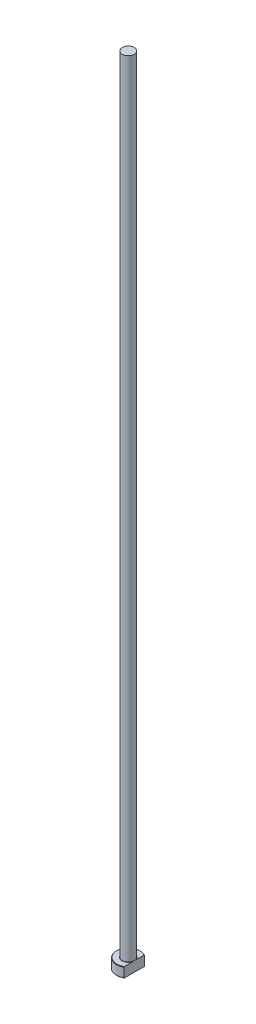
ISO-10303-21;
HEADER;
FILE_DESCRIPTION(('STEP AP214'),'2;1');
FILE_NAME('part.step','',(''),(''),'','','');
FILE_SCHEMA(('AUTOMOTIVE_DESIGN { 1 0 10303 214 1 1 1 1 }'));
ENDSEC;
DATA;
#1=APPLICATION_CONTEXT('core data for automotive mechanical design processes');
#2=APPLICATION_PROTOCOL_DEFINITION('international standard','automotive_design',2000,#1);
#3=PRODUCT_CONTEXT('',#1,'mechanical');
#4=PRODUCT('Part','Part','',(#3));
#5=PRODUCT_RELATED_PRODUCT_CATEGORY('part','',(#4));
#6=PRODUCT_DEFINITION_FORMATION('','',#4);
#7=PRODUCT_DEFINITION_CONTEXT('part definition',#1,'design');
#8=PRODUCT_DEFINITION('design','',#6,#7);
#9=PRODUCT_DEFINITION_SHAPE('','',#8);
#10=(LENGTH_UNIT() NAMED_UNIT(*) SI_UNIT(.MILLI.,.METRE.));
#11=(NAMED_UNIT(*) PLANE_ANGLE_UNIT() SI_UNIT($,.RADIAN.));
#12=(NAMED_UNIT(*) SI_UNIT($,.STERADIAN.) SOLID_ANGLE_UNIT());
#13=UNCERTAINTY_MEASURE_WITH_UNIT(LENGTH_MEASURE(1.E-05),#10,'distance_accuracy_value','');
#14=(GEOMETRIC_REPRESENTATION_CONTEXT(3) GLOBAL_UNCERTAINTY_ASSIGNED_CONTEXT((#13)) GLOBAL_UNIT_ASSIGNED_CONTEXT((#10,
#11,#12)) REPRESENTATION_CONTEXT('',''));
#15=CARTESIAN_POINT('',(0.,0.,0.));
#16=DIRECTION('',(0.,0.,1.));
#17=DIRECTION('',(1.,0.,0.));
#18=AXIS2_PLACEMENT_3D('',#15,#16,#17);
#19=CARTESIAN_POINT('',(0.,0.,0.));
#20=DIRECTION('',(0.,-1.,0.));
#21=DIRECTION('',(0.,0.,-1.));
#22=AXIS2_PLACEMENT_3D('',#19,#20,#21);
#23=PLANE('',#22);
#24=CARTESIAN_POINT('',(0.,0.,0.));
#25=DIRECTION('',(0.,-1.,0.));
#26=DIRECTION('',(0.,0.,-1.));
#27=AXIS2_PLACEMENT_3D('',#24,#25,#26);
#28=CIRCLE('',#27,5.79999999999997);
#29=CARTESIAN_POINT('',(2.99999999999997,0.,4.96386945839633));
#30=VERTEX_POINT('',#29);
#31=CARTESIAN_POINT('',(2.99999999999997,0.,-4.96386945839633));
#32=VERTEX_POINT('',#31);
#33=EDGE_CURVE('E98',#30,#32,#28,.T.);
#34=ORIENTED_EDGE('',*,*,#33,.T.);
#35=DIRECTION('',(0.,0.,1.));
#36=VECTOR('',#35,1.);
#37=CARTESIAN_POINT('',(2.99999999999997,0.,-5.19615242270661));
#38=LINE('',#37,#36);
#39=EDGE_CURVE('E83',#32,#30,#38,.T.);
#40=ORIENTED_EDGE('',*,*,#39,.T.);
#41=EDGE_LOOP('',(#34,#40));
#42=FACE_BOUND('',#41,.T.);
#43=ADVANCED_FACE('F32',(#42),#23,.T.);
#44=CARTESIAN_POINT('',(0.,259.958771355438,0.));
#45=DIRECTION('',(0.,1.,0.));
#46=DIRECTION('',(0.,0.,1.));
#47=AXIS2_PLACEMENT_3D('',#44,#45,#46);
#48=CYLINDRICAL_SURFACE('',#47,5.99999999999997);
#49=CARTESIAN_POINT('',(0.,4.80000000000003,0.));
#50=DIRECTION('',(0.,1.,0.));
#51=DIRECTION('',(0.,0.,1.));
#52=AXIS2_PLACEMENT_3D('',#49,#50,#51);
#53=CIRCLE('',#52,5.99999999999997);
#54=CARTESIAN_POINT('',(2.99999999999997,4.80000000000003,5.19615242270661));
#55=VERTEX_POINT('',#54);
#56=CARTESIAN_POINT('',(2.99999999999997,4.80000000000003,-5.19615242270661));
#57=VERTEX_POINT('',#56);
#58=EDGE_CURVE('E104',#55,#57,#53,.F.);
#59=ORIENTED_EDGE('',*,*,#58,.T.);
#60=DIRECTION('',(0.,-1.,0.));
#61=VECTOR('',#60,1.);
#62=CARTESIAN_POINT('',(2.99999999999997,400.,-5.19615242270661));
#63=LINE('',#62,#61);
#64=CARTESIAN_POINT('',(2.99999999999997,0.199999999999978,-5.19615242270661));
#65=VERTEX_POINT('',#64);
#66=EDGE_CURVE('E183',#57,#65,#63,.T.);
#67=ORIENTED_EDGE('',*,*,#66,.T.);
#68=CARTESIAN_POINT('',(0.,0.199999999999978,0.));
#69=DIRECTION('',(0.,-1.,0.));
#70=DIRECTION('',(0.,0.,-1.));
#71=AXIS2_PLACEMENT_3D('',#68,#69,#70);
#72=CIRCLE('',#71,5.99999999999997);
#73=CARTESIAN_POINT('',(2.99999999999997,0.199999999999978,5.19615242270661));
#74=VERTEX_POINT('',#73);
#75=EDGE_CURVE('E100',#65,#74,#72,.F.);
#76=ORIENTED_EDGE('',*,*,#75,.T.);
#77=DIRECTION('',(0.,-1.,0.));
#78=VECTOR('',#77,1.);
#79=CARTESIAN_POINT('',(2.99999999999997,400.,5.19615242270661));
#80=LINE('',#79,#78);
#81=EDGE_CURVE('E93',#55,#74,#80,.T.);
#82=ORIENTED_EDGE('',*,*,#81,.F.);
#83=EDGE_LOOP('',(#59,#67,#76,#82));
#84=FACE_BOUND('',#83,.T.);
#85=ADVANCED_FACE('F158',(#84),#48,.T.);
#86=CARTESIAN_POINT('',(-5.99999999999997,5.,0.));
#87=DIRECTION('',(0.,1.,0.));
#88=DIRECTION('',(0.,0.,1.));
#89=AXIS2_PLACEMENT_3D('',#86,#87,#88);
#90=PLANE('',#89);
#91=CARTESIAN_POINT('',(0.,5.,0.));
#92=DIRECTION('',(0.,1.,0.));
#93=DIRECTION('',(0.,0.,1.));
#94=AXIS2_PLACEMENT_3D('',#91,#92,#93);
#95=CIRCLE('',#94,5.79999999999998);
#96=CARTESIAN_POINT('',(2.99999999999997,5.,-4.96386945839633));
#97=VERTEX_POINT('',#96);
#98=CARTESIAN_POINT('',(2.99999999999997,5.,4.96386945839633));
#99=VERTEX_POINT('',#98);
#100=EDGE_CURVE('E178',#97,#99,#95,.T.);
#101=ORIENTED_EDGE('',*,*,#100,.T.);
#102=DIRECTION('',(0.,0.,-1.));
#103=VECTOR('',#102,1.);
#104=CARTESIAN_POINT('',(2.99999999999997,5.,0.));
#105=LINE('',#104,#103);
#106=CARTESIAN_POINT('',(2.99999999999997,4.99999999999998,1.11355287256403));
#107=VERTEX_POINT('',#106);
#108=EDGE_CURVE('E57',#99,#107,#105,.T.);
#109=ORIENTED_EDGE('',*,*,#108,.T.);
#110=CARTESIAN_POINT('',(0.,5.,0.));
#111=DIRECTION('',(0.,1.,0.));
#112=DIRECTION('',(0.,0.,1.));
#113=AXIS2_PLACEMENT_3D('',#110,#111,#112);
#114=CIRCLE('',#113,3.19999999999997);
#115=CARTESIAN_POINT('',(2.99999999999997,4.99999999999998,-1.113552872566));
#116=VERTEX_POINT('',#115);
#117=EDGE_CURVE('E107',#107,#116,#114,.F.);
#118=ORIENTED_EDGE('',*,*,#117,.T.);
#119=EDGE_CURVE('E136',#116,#97,#105,.T.);
#120=ORIENTED_EDGE('',*,*,#119,.T.);
#121=EDGE_LOOP('',(#101,#109,#118,#120));
#122=FACE_BOUND('',#121,.T.);
#123=ADVANCED_FACE('F147',(#122),#90,.T.);
#124=CARTESIAN_POINT('',(0.,5.,0.));
#125=DIRECTION('',(0.,-1.,0.));
#126=DIRECTION('',(0.,0.,-1.));
#127=AXIS2_PLACEMENT_3D('',#124,#125,#126);
#128=CONICAL_SURFACE('',#127,5.79999999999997,0.785398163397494);
#129=ORIENTED_EDGE('',*,*,#58,.F.);
#130=CARTESIAN_POINT('',(2.99999999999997,-1.01993959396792,11.432889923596));
#131=CARTESIAN_POINT('',(2.99999999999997,-0.769424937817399,11.1738796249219));
#132=CARTESIAN_POINT('',(2.99999999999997,-0.519179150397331,10.9146084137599));
#133=CARTESIAN_POINT('',(2.99999999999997,-0.0193842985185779,10.395389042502));
#134=CARTESIAN_POINT('',(2.99999999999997,0.230164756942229,10.1354408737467));
#135=CARTESIAN_POINT('',(2.99999999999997,0.728528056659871,9.61458602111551));
#136=CARTESIAN_POINT('',(2.99999999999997,0.977341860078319,9.35367891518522));
#137=CARTESIAN_POINT('',(2.99999999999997,1.47386965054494,8.83082274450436));
#138=CARTESIAN_POINT('',(2.99999999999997,1.72158364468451,8.56887368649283));
#139=CARTESIAN_POINT('',(2.99999999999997,2.21069282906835,8.04884148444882));
#140=CARTESIAN_POINT('',(2.99999999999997,2.4521159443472,7.79078462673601));
#141=CARTESIAN_POINT('',(2.99999999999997,2.93315589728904,7.27299342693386));
#142=CARTESIAN_POINT('',(2.99999999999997,3.17277274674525,7.01325909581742));
#143=CARTESIAN_POINT('',(2.99999999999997,3.64950020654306,6.49159990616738));
#144=CARTESIAN_POINT('',(2.99999999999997,3.88661134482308,6.22967553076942));
#145=CARTESIAN_POINT('',(2.99999999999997,4.35738571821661,5.70275148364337));
#146=CARTESIAN_POINT('',(2.99999999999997,4.59104909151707,5.43775193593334));
#147=CARTESIAN_POINT('',(2.99999999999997,4.96416348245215,5.00636825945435));
#148=CARTESIAN_POINT('',(2.99999999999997,5.1052013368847,4.8413584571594));
#149=CARTESIAN_POINT('',(2.99999999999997,5.38476673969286,4.50919282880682));
#150=CARTESIAN_POINT('',(2.99999999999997,5.52329404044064,4.34203679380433));
#151=CARTESIAN_POINT('',(2.99999999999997,5.79842961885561,4.0031993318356));
#152=CARTESIAN_POINT('',(2.99999999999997,5.93500216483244,3.83148875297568));
#153=CARTESIAN_POINT('',(2.99999999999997,6.20336281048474,3.4844211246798));
#154=CARTESIAN_POINT('',(2.99999999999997,6.33515205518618,3.30906496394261));
#155=CARTESIAN_POINT('',(2.99999999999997,6.5939338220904,2.9507080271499));
#156=CARTESIAN_POINT('',(2.99999999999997,6.72082315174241,2.76763161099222));
#157=CARTESIAN_POINT('',(2.99999999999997,6.90336321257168,2.48771743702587));
#158=CARTESIAN_POINT('',(2.99999999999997,6.96295431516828,2.39345390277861));
#159=CARTESIAN_POINT('',(2.99999999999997,7.07882720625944,2.20292146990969));
#160=CARTESIAN_POINT('',(2.99999999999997,7.13510937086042,2.10665280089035));
#161=CARTESIAN_POINT('',(2.99999999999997,7.24288059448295,1.91297779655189));
#162=CARTESIAN_POINT('',(2.99999999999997,7.29441986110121,1.81559978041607));
#163=CARTESIAN_POINT('',(2.99999999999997,7.39241237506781,1.61833215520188));
#164=CARTESIAN_POINT('',(2.99999999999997,7.43886469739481,1.51844209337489));
#165=CARTESIAN_POINT('',(2.99999999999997,7.56840030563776,1.21511948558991));
#166=CARTESIAN_POINT('',(2.99999999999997,7.64209011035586,1.00730397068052));
#167=CARTESIAN_POINT('',(2.99999999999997,7.72186700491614,0.695731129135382));
#168=CARTESIAN_POINT('',(2.99999999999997,7.74302901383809,0.595791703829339));
#169=CARTESIAN_POINT('',(2.99999999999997,7.77582528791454,0.394325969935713));
#170=CARTESIAN_POINT('',(2.99999999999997,7.78746040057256,0.292799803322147));
#171=CARTESIAN_POINT('',(2.99999999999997,7.80037895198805,0.0893987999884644));
#172=CARTESIAN_POINT('',(2.99999999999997,7.80169449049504,-0.0124739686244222));
#173=CARTESIAN_POINT('',(2.99999999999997,7.79396363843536,-0.215826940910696));
#174=CARTESIAN_POINT('',(2.99999999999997,7.78491639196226,-0.317307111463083));
#175=CARTESIAN_POINT('',(2.99999999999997,7.75721241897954,-0.518039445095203));
#176=CARTESIAN_POINT('',(2.99999999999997,7.73863812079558,-0.61730321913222));
#177=CARTESIAN_POINT('',(2.99999999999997,7.6930395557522,-0.813850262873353));
#178=CARTESIAN_POINT('',(2.99999999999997,7.66601427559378,-0.911133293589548));
#179=CARTESIAN_POINT('',(2.99999999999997,7.60464499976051,-1.10394843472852));
#180=CARTESIAN_POINT('',(2.99999999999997,7.57025976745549,-1.19946724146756));
#181=CARTESIAN_POINT('',(2.99999999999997,7.4955576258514,-1.38810736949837));
#182=CARTESIAN_POINT('',(2.99999999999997,7.45524192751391,-1.48122917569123));
#183=CARTESIAN_POINT('',(2.99999999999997,7.36961028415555,-1.66561491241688));
#184=CARTESIAN_POINT('',(2.99999999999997,7.32427350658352,-1.75686908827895));
#185=CARTESIAN_POINT('',(2.99999999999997,7.22966073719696,-1.93732130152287));
#186=CARTESIAN_POINT('',(2.99999999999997,7.18038388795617,-2.02651888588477));
#187=CARTESIAN_POINT('',(2.99999999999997,7.02771106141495,-2.29153460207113));
#188=CARTESIAN_POINT('',(2.99999999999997,6.91955486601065,-2.46460625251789));
#189=CARTESIAN_POINT('',(2.99999999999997,6.69440299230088,-2.80577028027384));
#190=CARTESIAN_POINT('',(2.99999999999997,6.57737415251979,-2.97384034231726));
#191=CARTESIAN_POINT('',(2.99999999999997,6.33748949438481,-3.30561771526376));
#192=CARTESIAN_POINT('',(2.99999999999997,6.21463662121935,-3.46932716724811));
#193=CARTESIAN_POINT('',(2.99999999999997,5.96308085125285,-3.79561670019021));
#194=CARTESIAN_POINT('',(2.99999999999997,5.83432224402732,-3.95815356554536));
#195=CARTESIAN_POINT('',(2.99999999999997,5.57361365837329,-4.28066737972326));
#196=CARTESIAN_POINT('',(2.99999999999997,5.44166333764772,-4.44064405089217));
#197=CARTESIAN_POINT('',(2.99999999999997,5.17568445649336,-4.75819552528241));
#198=CARTESIAN_POINT('',(2.99999999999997,5.04166171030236,-4.91577521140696));
#199=CARTESIAN_POINT('',(2.99999999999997,4.77176230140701,-5.22934053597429));
#200=CARTESIAN_POINT('',(2.99999999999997,4.63588560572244,-5.38532614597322));
#201=CARTESIAN_POINT('',(2.99999999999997,4.27256222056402,-5.79849838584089));
#202=CARTESIAN_POINT('',(2.99999999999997,4.04384014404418,-6.054562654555));
#203=CARTESIAN_POINT('',(2.99999999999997,3.58360020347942,-6.5641703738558));
#204=CARTESIAN_POINT('',(2.99999999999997,3.35208226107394,-6.81771375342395));
#205=CARTESIAN_POINT('',(2.99999999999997,2.88678846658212,-7.32315936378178));
#206=CARTESIAN_POINT('',(2.99999999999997,2.65301069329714,-7.57505982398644));
#207=CARTESIAN_POINT('',(2.99999999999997,2.18392232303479,-8.07742926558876));
#208=CARTESIAN_POINT('',(2.99999999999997,1.94861172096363,-8.32789824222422));
#209=CARTESIAN_POINT('',(2.99999999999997,1.4865158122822,-8.81743943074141));
#210=CARTESIAN_POINT('',(2.99999999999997,1.25977806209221,-9.05655656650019));
#211=CARTESIAN_POINT('',(2.99999999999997,0.805439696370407,-9.53397105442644));
#212=CARTESIAN_POINT('',(2.99999999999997,0.577839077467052,-9.77226840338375));
#213=CARTESIAN_POINT('',(2.99999999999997,0.122198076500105,-10.2479325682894));
#214=CARTESIAN_POINT('',(2.99999999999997,-0.105841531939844,-10.4853001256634));
#215=CARTESIAN_POINT('',(2.99999999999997,-0.562491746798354,-10.9594816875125));
#216=CARTESIAN_POINT('',(2.99999999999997,-0.791102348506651,-11.1962956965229));
#217=CARTESIAN_POINT('',(2.99999999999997,-1.01993959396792,-11.432889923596));
#218=B_SPLINE_CURVE_WITH_KNOTS('',3,(#130,#131,#132,#133,#134,#135,#136,#137,#138,#139,#140,
#141,#142,#143,#144,#145,#146,#147,#148,#149,#150,#151,#152,#153,#154,#155,#156,#157,#158,#159,
#160,#161,#162,#163,#164,#165,#166,#167,#168,#169,#170,#171,#172,#173,#174,#175,#176,#177,#178,
#179,#180,#181,#182,#183,#184,#185,#186,#187,#188,#189,#190,#191,#192,#193,#194,#195,#196,#197,
#198,#199,#200,#201,#202,#203,#204,#205,#206,#207,#208,#209,#210,#211,#212,#213,#214,#215,#216,
#217),.UNSPECIFIED.,.F.,.F.,(4,2,2,2,2,2,2,2,2,2,2,2,2,2,2,2,2,2,2,2,2,2,2,2,2,2,2,2,2,2,2,2,2,
2,2,2,2,2,2,2,2,2,2,4),(0.,1.08101662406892,2.16204714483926,3.24363027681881,4.32520642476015,
5.3853446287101,6.44547590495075,7.50537917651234,8.56523985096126,9.21643479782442,
9.86769362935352,10.5258323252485,11.1838124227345,11.851781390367,12.1862877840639,
12.5207560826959,12.8511332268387,13.1815703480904,13.8399161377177,14.1460077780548,
14.4520721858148,14.7571841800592,15.0623213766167,15.3648619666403,15.6674388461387,
15.9717575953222,16.2760142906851,16.5815843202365,16.8872210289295,17.4990577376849,
18.1133060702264,18.7272470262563,19.3492675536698,19.9713550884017,20.5919343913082,
21.2125247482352,22.2425132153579,23.2725306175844,24.3035181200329,25.3345090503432,
26.3230827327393,27.3116602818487,28.299135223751,29.286602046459),.UNSPECIFIED.);
#219=EDGE_CURVE('E135',#55,#99,#218,.T.);
#220=ORIENTED_EDGE('',*,*,#219,.T.);
#221=ORIENTED_EDGE('',*,*,#100,.F.);
#222=EDGE_CURVE('E127',#97,#57,#218,.T.);
#223=ORIENTED_EDGE('',*,*,#222,.T.);
#224=EDGE_LOOP('',(#129,#220,#221,#223));
#225=FACE_BOUND('',#224,.T.);
#226=ADVANCED_FACE('F143',(#225),#128,.T.);
#227=CARTESIAN_POINT('',(0.,0.199999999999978,0.));
#228=DIRECTION('',(0.,1.,0.));
#229=DIRECTION('',(0.,0.,1.));
#230=AXIS2_PLACEMENT_3D('',#227,#228,#229);
#231=CONICAL_SURFACE('',#230,5.99999999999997,0.785398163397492);
#232=ORIENTED_EDGE('',*,*,#75,.F.);
#233=CARTESIAN_POINT('',(2.99999999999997,6.01993959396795,-11.432889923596));
#234=CARTESIAN_POINT('',(2.99999999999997,5.76942493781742,-11.1738796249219));
#235=CARTESIAN_POINT('',(2.99999999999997,5.51917915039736,-10.9146084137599));
#236=CARTESIAN_POINT('',(2.99999999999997,5.0193842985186,-10.395389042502));
#237=CARTESIAN_POINT('',(2.99999999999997,4.76983524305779,-10.1354408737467));
#238=CARTESIAN_POINT('',(2.99999999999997,4.27147194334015,-9.6145860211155));
#239=CARTESIAN_POINT('',(2.99999999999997,4.0226581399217,-9.35367891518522));
#240=CARTESIAN_POINT('',(2.99999999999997,3.52613034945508,-8.83082274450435));
#241=CARTESIAN_POINT('',(2.99999999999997,3.27841635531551,-8.56887368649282));
#242=CARTESIAN_POINT('',(2.99999999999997,2.78930717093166,-8.04884148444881));
#243=CARTESIAN_POINT('',(2.99999999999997,2.54788405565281,-7.790784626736));
#244=CARTESIAN_POINT('',(2.99999999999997,2.06684410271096,-7.27299342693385));
#245=CARTESIAN_POINT('',(2.99999999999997,1.82722725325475,-7.01325909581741));
#246=CARTESIAN_POINT('',(2.99999999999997,1.35049979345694,-6.49159990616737));
#247=CARTESIAN_POINT('',(2.99999999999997,1.11338865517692,-6.22967553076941));
#248=CARTESIAN_POINT('',(2.99999999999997,0.642614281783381,-5.70275148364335));
#249=CARTESIAN_POINT('',(2.99999999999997,0.408950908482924,-5.43775193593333));
#250=CARTESIAN_POINT('',(2.99999999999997,0.0358365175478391,-5.00636825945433));
#251=CARTESIAN_POINT('',(2.99999999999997,-0.105201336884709,-4.84135845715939));
#252=CARTESIAN_POINT('',(2.99999999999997,-0.384766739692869,-4.50919282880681));
#253=CARTESIAN_POINT('',(2.99999999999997,-0.523294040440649,-4.34203679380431));
#254=CARTESIAN_POINT('',(2.99999999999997,-0.798429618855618,-4.00319933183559));
#255=CARTESIAN_POINT('',(2.99999999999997,-0.935002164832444,-3.83148875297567));
#256=CARTESIAN_POINT('',(2.99999999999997,-1.20336281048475,-3.48442112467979));
#257=CARTESIAN_POINT('',(2.99999999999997,-1.33515205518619,-3.3090649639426));
#258=CARTESIAN_POINT('',(2.99999999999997,-1.59393382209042,-2.95070802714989));
#259=CARTESIAN_POINT('',(2.99999999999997,-1.72082315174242,-2.76763161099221));
#260=CARTESIAN_POINT('',(2.99999999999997,-1.90336321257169,-2.48771743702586));
#261=CARTESIAN_POINT('',(2.99999999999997,-1.96295431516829,-2.3934539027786));
#262=CARTESIAN_POINT('',(2.99999999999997,-2.07882720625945,-2.20292146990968));
#263=CARTESIAN_POINT('',(2.99999999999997,-2.13510937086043,-2.10665280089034));
#264=CARTESIAN_POINT('',(2.99999999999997,-2.24288059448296,-1.91297779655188));
#265=CARTESIAN_POINT('',(2.99999999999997,-2.29441986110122,-1.81559978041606));
#266=CARTESIAN_POINT('',(2.99999999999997,-2.39241237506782,-1.61833215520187));
#267=CARTESIAN_POINT('',(2.99999999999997,-2.43886469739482,-1.51844209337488));
#268=CARTESIAN_POINT('',(2.99999999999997,-2.56840030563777,-1.2151194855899));
#269=CARTESIAN_POINT('',(2.99999999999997,-2.64209011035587,-1.00730397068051));
#270=CARTESIAN_POINT('',(2.99999999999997,-2.72186700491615,-0.695731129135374));
#271=CARTESIAN_POINT('',(2.99999999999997,-2.7430290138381,-0.59579170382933));
#272=CARTESIAN_POINT('',(2.99999999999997,-2.77582528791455,-0.394325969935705));
#273=CARTESIAN_POINT('',(2.99999999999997,-2.78746040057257,-0.29279980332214));
#274=CARTESIAN_POINT('',(2.99999999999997,-2.80037895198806,-0.0893987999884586));
#275=CARTESIAN_POINT('',(2.99999999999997,-2.80169449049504,0.0124739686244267));
#276=CARTESIAN_POINT('',(2.99999999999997,-2.79396363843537,0.215826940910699));
#277=CARTESIAN_POINT('',(2.99999999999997,-2.78491639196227,0.317307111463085));
#278=CARTESIAN_POINT('',(2.99999999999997,-2.75721241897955,0.518039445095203));
#279=CARTESIAN_POINT('',(2.99999999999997,-2.73863812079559,0.617303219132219));
#280=CARTESIAN_POINT('',(2.99999999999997,-2.6930395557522,0.813850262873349));
#281=CARTESIAN_POINT('',(2.99999999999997,-2.66601427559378,0.911133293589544));
#282=CARTESIAN_POINT('',(2.99999999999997,-2.60464499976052,1.10394843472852));
#283=CARTESIAN_POINT('',(2.99999999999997,-2.5702597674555,1.19946724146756));
#284=CARTESIAN_POINT('',(2.99999999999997,-2.49555762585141,1.38810736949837));
#285=CARTESIAN_POINT('',(2.99999999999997,-2.45524192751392,1.48122917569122));
#286=CARTESIAN_POINT('',(2.99999999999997,-2.36961028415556,1.66561491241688));
#287=CARTESIAN_POINT('',(2.99999999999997,-2.32427350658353,1.75686908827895));
#288=CARTESIAN_POINT('',(2.99999999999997,-2.22966073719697,1.93732130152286));
#289=CARTESIAN_POINT('',(2.99999999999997,-2.18038388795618,2.02651888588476));
#290=CARTESIAN_POINT('',(2.99999999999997,-2.02771106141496,2.29153460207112));
#291=CARTESIAN_POINT('',(2.99999999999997,-1.91955486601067,2.46460625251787));
#292=CARTESIAN_POINT('',(2.99999999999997,-1.6944029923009,2.80577028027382));
#293=CARTESIAN_POINT('',(2.99999999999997,-1.57737415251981,2.97384034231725));
#294=CARTESIAN_POINT('',(2.99999999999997,-1.33748949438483,3.30561771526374));
#295=CARTESIAN_POINT('',(2.99999999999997,-1.21463662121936,3.46932716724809));
#296=CARTESIAN_POINT('',(2.99999999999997,-0.963080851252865,3.79561670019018));
#297=CARTESIAN_POINT('',(2.99999999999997,-0.834322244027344,3.95815356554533));
#298=CARTESIAN_POINT('',(2.99999999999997,-0.573613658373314,4.28066737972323));
#299=CARTESIAN_POINT('',(2.99999999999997,-0.441663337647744,4.44064405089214));
#300=CARTESIAN_POINT('',(2.99999999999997,-0.175684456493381,4.75819552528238));
#301=CARTESIAN_POINT('',(2.99999999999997,-0.0416617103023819,4.91577521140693));
#302=CARTESIAN_POINT('',(2.99999999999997,0.228237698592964,5.22934053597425));
#303=CARTESIAN_POINT('',(2.99999999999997,0.364114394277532,5.38532614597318));
#304=CARTESIAN_POINT('',(2.99999999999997,0.727437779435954,5.79849838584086));
#305=CARTESIAN_POINT('',(2.99999999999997,0.956159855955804,6.05456265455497));
#306=CARTESIAN_POINT('',(2.99999999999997,1.41639979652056,6.56417037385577));
#307=CARTESIAN_POINT('',(2.99999999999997,1.64791773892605,6.81771375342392));
#308=CARTESIAN_POINT('',(2.99999999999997,2.11321153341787,7.32315936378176));
#309=CARTESIAN_POINT('',(2.99999999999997,2.34698930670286,7.57505982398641));
#310=CARTESIAN_POINT('',(2.99999999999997,2.8160776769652,8.07742926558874));
#311=CARTESIAN_POINT('',(2.99999999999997,3.05138827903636,8.3278982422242));
#312=CARTESIAN_POINT('',(2.99999999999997,3.5134841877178,8.81743943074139));
#313=CARTESIAN_POINT('',(2.99999999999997,3.7402219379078,9.05655656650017));
#314=CARTESIAN_POINT('',(2.99999999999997,4.1945603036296,9.53397105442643));
#315=CARTESIAN_POINT('',(2.99999999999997,4.42216092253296,9.77226840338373));
#316=CARTESIAN_POINT('',(2.99999999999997,4.87780192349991,10.2479325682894));
#317=CARTESIAN_POINT('',(2.99999999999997,5.10584153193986,10.4853001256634));
#318=CARTESIAN_POINT('',(2.99999999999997,5.56249174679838,10.9594816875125));
#319=CARTESIAN_POINT('',(2.99999999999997,5.79110234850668,11.1962956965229));
#320=CARTESIAN_POINT('',(2.99999999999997,6.01993959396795,11.432889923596));
#321=B_SPLINE_CURVE_WITH_KNOTS('',3,(#233,#234,#235,#236,#237,#238,#239,#240,#241,#242,#243,
#244,#245,#246,#247,#248,#249,#250,#251,#252,#253,#254,#255,#256,#257,#258,#259,#260,#261,#262,
#263,#264,#265,#266,#267,#268,#269,#270,#271,#272,#273,#274,#275,#276,#277,#278,#279,#280,#281,
#282,#283,#284,#285,#286,#287,#288,#289,#290,#291,#292,#293,#294,#295,#296,#297,#298,#299,#300,
#301,#302,#303,#304,#305,#306,#307,#308,#309,#310,#311,#312,#313,#314,#315,#316,#317,#318,#319,
#320),.UNSPECIFIED.,.F.,.F.,(4,2,2,2,2,2,2,2,2,2,2,2,2,2,2,2,2,2,2,2,2,2,2,2,2,2,2,2,2,2,2,2,2,
2,2,2,2,2,2,2,2,2,2,4),(0.,1.08101662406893,2.16204714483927,3.24363027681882,4.32520642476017,
5.38534462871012,6.44547590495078,7.50537917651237,8.5652398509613,9.21643479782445,
9.86769362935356,10.5258323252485,11.1838124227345,11.851781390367,12.186287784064,
12.5207560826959,12.8511332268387,13.1815703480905,13.8399161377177,14.1460077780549,
14.4520721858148,14.7571841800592,15.0623213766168,15.3648619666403,15.6674388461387,
15.9717575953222,16.2760142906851,16.5815843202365,16.8872210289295,17.4990577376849,
18.1133060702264,18.7272470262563,19.3492675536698,19.9713550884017,20.5919343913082,
21.2125247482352,22.2425132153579,23.2725306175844,24.3035181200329,25.3345090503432,
26.3230827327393,27.3116602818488,28.299135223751,29.286602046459),.UNSPECIFIED.);
#322=EDGE_CURVE('E86',#65,#32,#321,.T.);
#323=ORIENTED_EDGE('',*,*,#322,.T.);
#324=ORIENTED_EDGE('',*,*,#33,.F.);
#325=EDGE_CURVE('E89',#30,#74,#321,.T.);
#326=ORIENTED_EDGE('',*,*,#325,.T.);
#327=EDGE_LOOP('',(#232,#323,#324,#326));
#328=FACE_BOUND('',#327,.T.);
#329=ADVANCED_FACE('F97',(#328),#231,.T.);
#330=CARTESIAN_POINT('',(0.,5.19999999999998,0.));
#331=DIRECTION('',(0.,1.,0.));
#332=DIRECTION('',(0.,0.,1.));
#333=AXIS2_PLACEMENT_3D('',#330,#331,#332);
#334=TOROIDAL_SURFACE('',#333,3.19999999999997,0.2);
#335=CARTESIAN_POINT('',(2.99999999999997,5.19999999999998,0.));
#336=CARTESIAN_POINT('',(2.99999999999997,5.20000054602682,-8.25589702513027E-09));
#337=CARTESIAN_POINT('',(2.99999999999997,5.20000108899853,-2.22623702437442E-07));
#338=CARTESIAN_POINT('',(2.99999999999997,5.20000210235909,-8.13181300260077E-07));
#339=CARTESIAN_POINT('',(2.99999999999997,5.20000256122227,-1.20262206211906E-06));
#340=CARTESIAN_POINT('',(2.99999999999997,5.20000351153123,-2.13233189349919E-06));
#341=CARTESIAN_POINT('',(2.99999999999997,5.2000039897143,-2.68711073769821E-06));
#342=CARTESIAN_POINT('',(2.99999999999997,5.20000484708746,-3.83722986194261E-06));
#343=CARTESIAN_POINT('',(2.99999999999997,5.20000522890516,-4.43075968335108E-06));
#344=CARTESIAN_POINT('',(2.99999999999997,5.20000663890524,-6.71805399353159E-06));
#345=CARTESIAN_POINT('',(2.99999999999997,5.20000758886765,-8.46267320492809E-06));
#346=CARTESIAN_POINT('',(2.99999999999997,5.20000915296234,-1.19195937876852E-05));
#347=CARTESIAN_POINT('',(2.99999999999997,5.20000978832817,-1.36226966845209E-05));
#348=CARTESIAN_POINT('',(2.99999999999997,5.20001243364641,-2.07785327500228E-05));
#349=CARTESIAN_POINT('',(2.99999999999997,5.20001439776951,-2.62512686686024E-05));
#350=CARTESIAN_POINT('',(2.99999999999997,5.20001730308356,-3.65971251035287E-05));
#351=CARTESIAN_POINT('',(2.99999999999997,5.20001835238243,-4.14397201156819E-05));
#352=CARTESIAN_POINT('',(2.99999999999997,5.20002589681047,-7.68826107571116E-05));
#353=CARTESIAN_POINT('',(2.99999999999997,5.20003169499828,-0.000107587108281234));
#354=CARTESIAN_POINT('',(2.99999999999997,5.20005649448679,-0.000225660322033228));
#355=CARTESIAN_POINT('',(2.99999999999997,5.2000799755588,-0.000312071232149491));
#356=CARTESIAN_POINT('',(2.99999999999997,5.2001671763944,-0.000638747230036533));
#357=CARTESIAN_POINT('',(2.99999999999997,5.20022823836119,-0.000879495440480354));
#358=CARTESIAN_POINT('',(2.99999999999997,5.20046253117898,-0.00179757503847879));
#359=CARTESIAN_POINT('',(2.99999999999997,5.20063826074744,-0.00247448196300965));
#360=CARTESIAN_POINT('',(2.99999999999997,5.20145771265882,-0.00563611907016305));
#361=CARTESIAN_POINT('',(2.99999999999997,5.20209802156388,-0.00812138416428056));
#362=CARTESIAN_POINT('',(2.99999999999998,5.207470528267,-0.0289666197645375));
#363=CARTESIAN_POINT('',(2.99999999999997,5.2122144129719,-0.0473249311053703));
#364=CARTESIAN_POINT('',(2.99999999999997,5.2215041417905,-0.0833908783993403));
#365=CARTESIAN_POINT('',(2.99999999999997,5.22605099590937,-0.101098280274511));
#366=CARTESIAN_POINT('',(2.99999999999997,5.24071513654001,-0.158441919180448));
#367=CARTESIAN_POINT('',(2.99999999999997,5.25076238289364,-0.198096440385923));
#368=CARTESIAN_POINT('',(2.99999999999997,5.26735876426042,-0.264903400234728));
#369=CARTESIAN_POINT('',(2.99999999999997,5.27400650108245,-0.292031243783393));
#370=CARTESIAN_POINT('',(2.99999999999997,5.28691139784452,-0.345693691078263));
#371=CARTESIAN_POINT('',(2.99999999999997,5.29317409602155,-0.372226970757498));
#372=CARTESIAN_POINT('',(2.99999999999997,5.31359314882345,-0.460847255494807));
#373=CARTESIAN_POINT('',(2.99999999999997,5.3271194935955,-0.52308420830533));
#374=CARTESIAN_POINT('',(2.99999999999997,5.35185224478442,-0.648627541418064));
#375=CARTESIAN_POINT('',(2.99999999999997,5.36303576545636,-0.711938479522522));
#376=CARTESIAN_POINT('',(2.99999999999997,5.382697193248,-0.845442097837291));
#377=CARTESIAN_POINT('',(2.99999999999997,5.39079783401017,-0.915695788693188));
#378=CARTESIAN_POINT('',(2.99999999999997,5.39788104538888,-1.02128246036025));
#379=CARTESIAN_POINT('',(2.99999999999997,5.399399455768,-1.05644278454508));
#380=CARTESIAN_POINT('',(2.99999999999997,5.40031405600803,-1.12678521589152));
#381=CARTESIAN_POINT('',(2.99999999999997,5.39971158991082,-1.16196729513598));
#382=CARTESIAN_POINT('',(2.99999999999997,5.39660553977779,-1.21713951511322));
#383=CARTESIAN_POINT('',(2.99999999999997,5.39502683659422,-1.23718181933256));
#384=CARTESIAN_POINT('',(2.99999999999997,5.39080008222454,-1.27717351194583));
#385=CARTESIAN_POINT('',(2.99999999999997,5.38815120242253,-1.29712281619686));
#386=CARTESIAN_POINT('',(2.99999999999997,5.38160570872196,-1.33655702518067));
#387=CARTESIAN_POINT('',(2.99999999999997,5.37772556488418,-1.35604460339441));
#388=CARTESIAN_POINT('',(2.99999999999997,5.36841119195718,-1.39463554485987));
#389=CARTESIAN_POINT('',(2.99999999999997,5.36297874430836,-1.41373932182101));
#390=CARTESIAN_POINT('',(2.99999999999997,5.3500393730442,-1.45151809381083));
#391=CARTESIAN_POINT('',(2.99999999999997,5.34250654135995,-1.47018435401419));
#392=CARTESIAN_POINT('',(2.99999999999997,5.32469433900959,-1.50617232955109));
#393=CARTESIAN_POINT('',(2.99999999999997,5.31442814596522,-1.52349999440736));
#394=CARTESIAN_POINT('',(2.99999999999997,5.29768486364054,-1.5453003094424));
#395=CARTESIAN_POINT('',(2.99999999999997,5.29285641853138,-1.551032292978));
#396=CARTESIAN_POINT('',(2.99999999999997,5.28257691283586,-1.56192749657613));
#397=CARTESIAN_POINT('',(2.99999999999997,5.27712536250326,-1.56709026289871));
#398=CARTESIAN_POINT('',(2.99999999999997,5.26548354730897,-1.57666725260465));
#399=CARTESIAN_POINT('',(2.99999999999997,5.25928560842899,-1.58107232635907));
#400=CARTESIAN_POINT('',(2.99999999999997,5.24620912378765,-1.5887219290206));
#401=CARTESIAN_POINT('',(2.99999999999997,5.23933242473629,-1.59196950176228));
#402=CARTESIAN_POINT('',(2.99999999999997,5.22702406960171,-1.5962468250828));
#403=CARTESIAN_POINT('',(2.99999999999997,5.2217197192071,-1.59764171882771));
#404=CARTESIAN_POINT('',(2.99999999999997,5.2109516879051,-1.59951721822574));
#405=CARTESIAN_POINT('',(2.99999999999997,5.20548813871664,-1.59999855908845));
#406=CARTESIAN_POINT('',(2.99999999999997,5.19455397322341,-1.60000143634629));
#407=CARTESIAN_POINT('',(2.99999999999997,5.18908335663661,-1.59952177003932));
#408=CARTESIAN_POINT('',(2.99999999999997,5.17830149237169,-1.59764696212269));
#409=CARTESIAN_POINT('',(2.99999999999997,5.17299036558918,-1.59625114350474));
#410=CARTESIAN_POINT('',(2.99999999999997,5.16137413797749,-1.5922159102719));
#411=CARTESIAN_POINT('',(2.99999999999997,5.15514663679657,-1.58935479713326));
#412=CARTESIAN_POINT('',(2.99999999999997,5.14323789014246,-1.58266473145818));
#413=CARTESIAN_POINT('',(2.99999999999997,5.13755768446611,-1.57883398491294));
#414=CARTESIAN_POINT('',(2.99999999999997,5.12388989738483,-1.5682309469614));
#415=CARTESIAN_POINT('',(2.99999999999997,5.11627920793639,-1.56097697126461));
#416=CARTESIAN_POINT('',(2.99999999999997,5.10222993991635,-1.54541986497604));
#417=CARTESIAN_POINT('',(2.99999999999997,5.09579438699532,-1.53711411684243));
#418=CARTESIAN_POINT('',(2.99999999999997,5.07874447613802,-1.51234359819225));
#419=CARTESIAN_POINT('',(2.99999999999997,5.06934681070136,-1.49505024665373));
#420=CARTESIAN_POINT('',(2.99999999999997,5.05300413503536,-1.45936637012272));
#421=CARTESIAN_POINT('',(2.99999999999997,5.04606563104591,-1.440973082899));
#422=CARTESIAN_POINT('',(2.99999999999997,5.03343712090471,-1.40170303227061));
#423=CARTESIAN_POINT('',(2.99999999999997,5.02794514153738,-1.38076360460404));
#424=CARTESIAN_POINT('',(2.99999999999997,5.01869119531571,-1.33849708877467));
#425=CARTESIAN_POINT('',(2.99999999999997,5.01493126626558,-1.31716957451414));
#426=CARTESIAN_POINT('',(2.99999999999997,5.00879575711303,-1.27427301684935));
#427=CARTESIAN_POINT('',(2.99999999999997,5.00642327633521,-1.25270354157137));
#428=CARTESIAN_POINT('',(2.99999999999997,5.00283272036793,-1.20948719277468));
#429=CARTESIAN_POINT('',(2.99999999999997,5.00161392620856,-1.18784037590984));
#430=CARTESIAN_POINT('',(2.99999999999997,4.99921193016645,-1.11739576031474));
#431=CARTESIAN_POINT('',(2.99999999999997,4.99998309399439,-1.06853061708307));
#432=CARTESIAN_POINT('',(2.99999999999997,5.00498456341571,-0.970964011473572));
#433=CARTESIAN_POINT('',(2.99999999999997,5.00921876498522,-0.922262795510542));
#434=CARTESIAN_POINT('',(2.99999999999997,5.02027934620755,-0.825023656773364));
#435=CARTESIAN_POINT('',(2.99999999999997,5.02711306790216,-0.776486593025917));
#436=CARTESIAN_POINT('',(2.99999999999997,5.04272509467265,-0.679720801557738));
#437=CARTESIAN_POINT('',(2.99999999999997,5.05150395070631,-0.631492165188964));
#438=CARTESIAN_POINT('',(2.99999999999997,5.07999589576,-0.487173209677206));
#439=CARTESIAN_POINT('',(2.99999999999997,5.10185558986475,-0.391514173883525));
#440=CARTESIAN_POINT('',(2.99999999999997,5.14819769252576,-0.200831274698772));
#441=CARTESIAN_POINT('',(2.99999999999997,5.17268119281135,-0.105807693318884));
#442=CARTESIAN_POINT('',(2.99999999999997,5.19722910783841,-0.0107318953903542));
#443=CARTESIAN_POINT('',(2.99999999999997,5.19724528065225,-0.0106692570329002));
#444=CARTESIAN_POINT('',(2.99999999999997,5.19781243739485,-0.00847232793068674));
#445=CARTESIAN_POINT('',(2.99999999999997,5.19836102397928,-0.00633759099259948));
#446=CARTESIAN_POINT('',(2.99999999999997,5.1991597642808,-0.00325873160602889));
#447=CARTESIAN_POINT('',(2.99999999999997,5.19940591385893,-0.00231386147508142));
#448=CARTESIAN_POINT('',(2.99999999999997,5.19972567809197,-0.00105818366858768));
#449=CARTESIAN_POINT('',(2.99999999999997,5.19980400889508,-0.000748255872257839));
#450=CARTESIAN_POINT('',(2.99999999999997,5.1999122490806,-0.000340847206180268));
#451=CARTESIAN_POINT('',(2.99999999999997,5.19993871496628,-0.000242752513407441));
#452=CARTESIAN_POINT('',(2.99999999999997,5.19996623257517,-0.000111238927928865));
#453=CARTESIAN_POINT('',(2.99999999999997,5.19997237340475,-7.89037769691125E-05));
#454=CARTESIAN_POINT('',(2.99999999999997,5.19998062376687,-4.17973012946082E-05));
#455=CARTESIAN_POINT('',(2.99999999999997,5.19998174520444,-3.68646325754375E-05));
#456=CARTESIAN_POINT('',(2.99999999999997,5.19998486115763,-2.6333709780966E-05));
#457=CARTESIAN_POINT('',(2.99999999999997,5.19998697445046,-2.0770778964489E-05));
#458=CARTESIAN_POINT('',(2.99999999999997,5.19998981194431,-1.35213137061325E-05));
#459=CARTESIAN_POINT('',(2.99999999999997,5.19999048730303,-1.18115060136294E-05));
#460=CARTESIAN_POINT('',(2.99999999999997,5.19999214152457,-8.34771962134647E-06));
#461=CARTESIAN_POINT('',(2.99999999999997,5.19999314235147,-6.60378870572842E-06));
#462=CARTESIAN_POINT('',(2.99999999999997,5.1999946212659,-4.32501646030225E-06));
#463=CARTESIAN_POINT('',(2.99999999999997,5.1999950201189,-3.73587510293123E-06));
#464=CARTESIAN_POINT('',(2.99999999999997,5.19999591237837,-2.59760768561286E-06));
#465=CARTESIAN_POINT('',(2.99999999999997,5.19999640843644,-2.05040430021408E-06));
#466=CARTESIAN_POINT('',(2.99999999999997,5.19999738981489,-1.1384674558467E-06));
#467=CARTESIAN_POINT('',(2.99999999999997,5.19999786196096,-7.58552551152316E-07));
#468=CARTESIAN_POINT('',(2.99999999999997,5.19999889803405,-1.92079005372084E-07));
#469=CARTESIAN_POINT('',(2.99999999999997,5.19999945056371,8.30744745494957E-09));
#470=CARTESIAN_POINT('',(2.99999999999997,5.19999999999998,0.));
#471=B_SPLINE_CURVE_WITH_KNOTS('',3,(#335,#336,#337,#338,#339,#340,#341,#342,#343,#344,#345,
#346,#347,#348,#349,#350,#351,#352,#353,#354,#355,#356,#357,#358,#359,#360,#361,#362,#363,#364,
#365,#366,#367,#368,#369,#370,#371,#372,#373,#374,#375,#376,#377,#378,#379,#380,#381,#382,#383,
#384,#385,#386,#387,#388,#389,#390,#391,#392,#393,#394,#395,#396,#397,#398,#399,#400,#401,#402,
#403,#404,#405,#406,#407,#408,#409,#410,#411,#412,#413,#414,#415,#416,#417,#418,#419,#420,#421,
#422,#423,#424,#425,#426,#427,#428,#429,#430,#431,#432,#433,#434,#435,#436,#437,#438,#439,#440,
#441,#442,#443,#444,#445,#446,#447,#448,#449,#450,#451,#452,#453,#454,#455,#456,#457,#458,#459,
#460,#461,#462,#463,#464,#465,#466,#467,#468,#469,#470),.UNSPECIFIED.,.T.,.F.,(4,2,2,2,2,2,2,2,
2,2,2,2,2,2,2,2,2,2,2,2,2,2,2,2,2,2,2,2,2,2,2,2,2,2,2,2,2,2,2,2,2,2,2,2,2,2,2,2,2,2,2,2,2,2,2,2,
2,2,2,2,2,2,2,2,2,2,2,4),(0.,1.65204701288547E-06,3.45848810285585E-06,5.64280272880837E-06,
7.75882449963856E-06,1.36969712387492E-05,1.9145444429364E-05,3.65603925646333E-05,
5.14083087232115E-05,0.000145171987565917,0.000413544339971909,0.00115890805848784,
0.00325667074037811,0.0109563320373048,0.067838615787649,0.122684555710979,0.245405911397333,
0.329196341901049,0.410983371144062,0.602016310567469,0.79483628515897,1.00673763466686,
1.11227258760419,1.21774067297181,1.27803175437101,1.33836960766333,1.39793215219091,
1.45742661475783,1.51769013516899,1.57766822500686,1.60011625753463,1.62258205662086,
1.64530254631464,1.66796284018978,1.68434680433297,1.70071757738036,1.71710885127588,
1.7335122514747,1.75395806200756,1.77444198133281,1.8058056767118,1.83724902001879,
1.89596356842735,1.95483231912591,2.01967230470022,2.08458838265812,2.14964892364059,
2.21466889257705,2.3610799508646,2.50765595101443,2.65464904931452,2.80168383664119,
3.09594779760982,3.39033467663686,3.39052875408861,3.3971415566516,3.40007033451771,
3.40102967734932,3.4013342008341,3.40143296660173,3.40144812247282,3.40146594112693,
3.40147145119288,3.401477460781,3.40147959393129,3.40148179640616,3.40148361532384,
3.40148527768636),.UNSPECIFIED.);
#472=CARTESIAN_POINT('',(2.99999999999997,5.19999999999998,0.));
#473=VERTEX_POINT('',#472);
#474=EDGE_CURVE('E11',#116,#473,#471,.T.);
#475=ORIENTED_EDGE('',*,*,#474,.F.);
#476=ORIENTED_EDGE('',*,*,#117,.F.);
#477=CARTESIAN_POINT('',(2.99999999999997,5.19999999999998,0.));
#478=CARTESIAN_POINT('',(2.99999999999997,5.19999945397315,8.25589702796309E-09));
#479=CARTESIAN_POINT('',(2.99999999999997,5.19999891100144,2.22623702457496E-07));
#480=CARTESIAN_POINT('',(2.99999999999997,5.19999789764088,8.13181300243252E-07));
#481=CARTESIAN_POINT('',(2.99999999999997,5.19999743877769,1.20262206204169E-06));
#482=CARTESIAN_POINT('',(2.99999999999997,5.19999648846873,2.13233189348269E-06));
#483=CARTESIAN_POINT('',(2.99999999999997,5.19999601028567,2.68711073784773E-06));
#484=CARTESIAN_POINT('',(2.99999999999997,5.19999515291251,3.83722986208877E-06));
#485=CARTESIAN_POINT('',(2.99999999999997,5.1999947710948,4.43075968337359E-06));
#486=CARTESIAN_POINT('',(2.99999999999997,5.19999336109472,6.71805399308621E-06));
#487=CARTESIAN_POINT('',(2.99999999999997,5.19999241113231,8.46267320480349E-06));
#488=CARTESIAN_POINT('',(2.99999999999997,5.19999084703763,1.19195937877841E-05));
#489=CARTESIAN_POINT('',(2.99999999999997,5.1999902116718,1.36226966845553E-05));
#490=CARTESIAN_POINT('',(2.99999999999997,5.19998756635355,2.07785327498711E-05));
#491=CARTESIAN_POINT('',(2.99999999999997,5.19998560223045,2.62512686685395E-05));
#492=CARTESIAN_POINT('',(2.99999999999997,5.1999826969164,3.65971251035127E-05));
#493=CARTESIAN_POINT('',(2.99999999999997,5.19998164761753,4.14397201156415E-05));
#494=CARTESIAN_POINT('',(2.99999999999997,5.19997410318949,7.68826107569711E-05));
#495=CARTESIAN_POINT('',(2.99999999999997,5.19996830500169,0.000107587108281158));
#496=CARTESIAN_POINT('',(2.99999999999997,5.19994350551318,0.000225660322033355));
#497=CARTESIAN_POINT('',(2.99999999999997,5.19992002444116,0.000312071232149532));
#498=CARTESIAN_POINT('',(2.99999999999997,5.19983282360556,0.000638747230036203));
#499=CARTESIAN_POINT('',(2.99999999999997,5.19977176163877,0.000879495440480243));
#500=CARTESIAN_POINT('',(2.99999999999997,5.19953746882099,0.00179757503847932));
#501=CARTESIAN_POINT('',(2.99999999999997,5.19936173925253,0.00247448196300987));
#502=CARTESIAN_POINT('',(2.99999999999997,5.19854228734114,0.00563611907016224));
#503=CARTESIAN_POINT('',(2.99999999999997,5.19790197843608,0.0081213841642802));
#504=CARTESIAN_POINT('',(2.99999999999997,5.19252947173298,0.0289666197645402));
#505=CARTESIAN_POINT('',(2.99999999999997,5.18778558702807,0.0473249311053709));
#506=CARTESIAN_POINT('',(2.99999999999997,5.17849585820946,0.0833908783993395));
#507=CARTESIAN_POINT('',(2.99999999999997,5.17394900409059,0.101098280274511));
#508=CARTESIAN_POINT('',(2.99999999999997,5.15928486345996,0.158441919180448));
#509=CARTESIAN_POINT('',(2.99999999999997,5.14923761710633,0.198096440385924));
#510=CARTESIAN_POINT('',(2.99999999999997,5.13264123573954,0.264903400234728));
#511=CARTESIAN_POINT('',(2.99999999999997,5.12599349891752,0.292031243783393));
#512=CARTESIAN_POINT('',(2.99999999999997,5.11308860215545,0.345693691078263));
#513=CARTESIAN_POINT('',(2.99999999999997,5.10682590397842,0.372226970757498));
#514=CARTESIAN_POINT('',(2.99999999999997,5.08640685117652,0.460847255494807));
#515=CARTESIAN_POINT('',(2.99999999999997,5.07288050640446,0.52308420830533));
#516=CARTESIAN_POINT('',(2.99999999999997,5.04814775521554,0.648627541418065));
#517=CARTESIAN_POINT('',(2.99999999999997,5.0369642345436,0.711938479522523));
#518=CARTESIAN_POINT('',(2.99999999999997,5.01730280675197,0.845442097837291));
#519=CARTESIAN_POINT('',(2.99999999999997,5.0092021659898,0.915695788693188));
#520=CARTESIAN_POINT('',(2.99999999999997,5.00211895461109,1.02128246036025));
#521=CARTESIAN_POINT('',(2.99999999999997,5.00060054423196,1.05644278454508));
#522=CARTESIAN_POINT('',(2.99999999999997,4.99968594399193,1.12678521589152));
#523=CARTESIAN_POINT('',(2.99999999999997,5.00028841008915,1.16196729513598));
#524=CARTESIAN_POINT('',(2.99999999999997,5.00339446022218,1.21713951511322));
#525=CARTESIAN_POINT('',(2.99999999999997,5.00497316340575,1.23718181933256));
#526=CARTESIAN_POINT('',(2.99999999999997,5.00919991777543,1.27717351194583));
#527=CARTESIAN_POINT('',(2.99999999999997,5.01184879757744,1.29712281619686));
#528=CARTESIAN_POINT('',(2.99999999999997,5.01839429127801,1.33655702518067));
#529=CARTESIAN_POINT('',(2.99999999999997,5.02227443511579,1.35604460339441));
#530=CARTESIAN_POINT('',(2.99999999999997,5.03158880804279,1.39463554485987));
#531=CARTESIAN_POINT('',(2.99999999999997,5.0370212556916,1.41373932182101));
#532=CARTESIAN_POINT('',(2.99999999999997,5.04996062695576,1.45151809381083));
#533=CARTESIAN_POINT('',(2.99999999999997,5.05749345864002,1.47018435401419));
#534=CARTESIAN_POINT('',(2.99999999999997,5.07530566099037,1.50617232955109));
#535=CARTESIAN_POINT('',(2.99999999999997,5.08557185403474,1.52349999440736));
#536=CARTESIAN_POINT('',(2.99999999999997,5.10231513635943,1.5453003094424));
#537=CARTESIAN_POINT('',(2.99999999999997,5.10714358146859,1.551032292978));
#538=CARTESIAN_POINT('',(2.99999999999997,5.1174230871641,1.56192749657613));
#539=CARTESIAN_POINT('',(2.99999999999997,5.1228746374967,1.56709026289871));
#540=CARTESIAN_POINT('',(2.99999999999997,5.13451645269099,1.57666725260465));
#541=CARTESIAN_POINT('',(2.99999999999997,5.14071439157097,1.58107232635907));
#542=CARTESIAN_POINT('',(2.99999999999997,5.15379087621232,1.5887219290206));
#543=CARTESIAN_POINT('',(2.99999999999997,5.16066757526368,1.59196950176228));
#544=CARTESIAN_POINT('',(2.99999999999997,5.17297593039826,1.5962468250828));
#545=CARTESIAN_POINT('',(2.99999999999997,5.17828028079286,1.59764171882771));
#546=CARTESIAN_POINT('',(2.99999999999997,5.18904831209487,1.59951721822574));
#547=CARTESIAN_POINT('',(2.99999999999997,5.19451186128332,1.59999855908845));
#548=CARTESIAN_POINT('',(2.99999999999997,5.20544602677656,1.60000143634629));
#549=CARTESIAN_POINT('',(2.99999999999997,5.21091664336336,1.59952177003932));
#550=CARTESIAN_POINT('',(2.99999999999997,5.22169850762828,1.59764696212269));
#551=CARTESIAN_POINT('',(2.99999999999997,5.22700963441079,1.59625114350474));
#552=CARTESIAN_POINT('',(2.99999999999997,5.23862586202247,1.5922159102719));
#553=CARTESIAN_POINT('',(2.99999999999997,5.2448533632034,1.58935479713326));
#554=CARTESIAN_POINT('',(2.99999999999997,5.2567621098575,1.58266473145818));
#555=CARTESIAN_POINT('',(2.99999999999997,5.26244231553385,1.57883398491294));
#556=CARTESIAN_POINT('',(2.99999999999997,5.27611010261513,1.5682309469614));
#557=CARTESIAN_POINT('',(2.99999999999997,5.28372079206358,1.56097697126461));
#558=CARTESIAN_POINT('',(2.99999999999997,5.29777006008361,1.54541986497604));
#559=CARTESIAN_POINT('',(2.99999999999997,5.30420561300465,1.53711411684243));
#560=CARTESIAN_POINT('',(2.99999999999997,5.32125552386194,1.51234359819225));
#561=CARTESIAN_POINT('',(2.99999999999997,5.33065318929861,1.49505024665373));
#562=CARTESIAN_POINT('',(2.99999999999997,5.34699586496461,1.45936637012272));
#563=CARTESIAN_POINT('',(2.99999999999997,5.35393436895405,1.440973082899));
#564=CARTESIAN_POINT('',(2.99999999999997,5.36656287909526,1.40170303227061));
#565=CARTESIAN_POINT('',(2.99999999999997,5.37205485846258,1.38076360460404));
#566=CARTESIAN_POINT('',(2.99999999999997,5.38130880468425,1.33849708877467));
#567=CARTESIAN_POINT('',(2.99999999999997,5.38506873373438,1.31716957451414));
#568=CARTESIAN_POINT('',(2.99999999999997,5.39120424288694,1.27427301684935));
#569=CARTESIAN_POINT('',(2.99999999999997,5.39357672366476,1.25270354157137));
#570=CARTESIAN_POINT('',(2.99999999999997,5.39716727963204,1.20948719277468));
#571=CARTESIAN_POINT('',(2.99999999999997,5.39838607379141,1.18784037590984));
#572=CARTESIAN_POINT('',(2.99999999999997,5.40078806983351,1.11739576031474));
#573=CARTESIAN_POINT('',(2.99999999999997,5.40001690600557,1.06853061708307));
#574=CARTESIAN_POINT('',(2.99999999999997,5.39501543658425,0.970964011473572));
#575=CARTESIAN_POINT('',(2.99999999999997,5.39078123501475,0.922262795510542));
#576=CARTESIAN_POINT('',(2.99999999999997,5.37972065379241,0.825023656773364));
#577=CARTESIAN_POINT('',(2.99999999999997,5.37288693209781,0.776486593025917));
#578=CARTESIAN_POINT('',(2.99999999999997,5.35727490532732,0.679720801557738));
#579=CARTESIAN_POINT('',(2.99999999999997,5.34849604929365,0.631492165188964));
#580=CARTESIAN_POINT('',(2.99999999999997,5.32000410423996,0.487173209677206));
#581=CARTESIAN_POINT('',(2.99999999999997,5.29814441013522,0.391514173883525));
#582=CARTESIAN_POINT('',(2.99999999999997,5.2518023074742,0.200831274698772));
#583=CARTESIAN_POINT('',(2.99999999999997,5.22731880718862,0.105807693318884));
#584=CARTESIAN_POINT('',(2.99999999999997,5.20277089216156,0.0107318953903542));
#585=CARTESIAN_POINT('',(2.99999999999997,5.20275471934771,0.0106692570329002));
#586=CARTESIAN_POINT('',(2.99999999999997,5.20218756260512,0.00847232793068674));
#587=CARTESIAN_POINT('',(2.99999999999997,5.20163897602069,0.00633759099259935));
#588=CARTESIAN_POINT('',(2.99999999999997,5.20084023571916,0.00325873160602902));
#589=CARTESIAN_POINT('',(2.99999999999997,5.20059408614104,0.00231386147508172));
#590=CARTESIAN_POINT('',(2.99999999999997,5.20027432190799,0.00105818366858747));
#591=CARTESIAN_POINT('',(2.99999999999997,5.20019599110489,0.000748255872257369));
#592=CARTESIAN_POINT('',(2.99999999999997,5.20008775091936,0.000340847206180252));
#593=CARTESIAN_POINT('',(2.99999999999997,5.20006128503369,0.000242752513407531));
#594=CARTESIAN_POINT('',(2.99999999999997,5.20003376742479,0.000111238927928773));
#595=CARTESIAN_POINT('',(2.99999999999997,5.20002762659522,7.89037769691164E-05));
#596=CARTESIAN_POINT('',(2.99999999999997,5.2000193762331,4.17973012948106E-05));
#597=CARTESIAN_POINT('',(2.99999999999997,5.20001825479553,3.68646325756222E-05));
#598=CARTESIAN_POINT('',(2.99999999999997,5.20001513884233,2.6333709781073E-05));
#599=CARTESIAN_POINT('',(2.99999999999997,5.2000130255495,2.07707789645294E-05));
#600=CARTESIAN_POINT('',(2.99999999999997,5.20001018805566,1.35213137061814E-05));
#601=CARTESIAN_POINT('',(2.99999999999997,5.20000951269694,1.18115060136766E-05));
#602=CARTESIAN_POINT('',(2.99999999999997,5.2000078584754,8.34771962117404E-06));
#603=CARTESIAN_POINT('',(2.99999999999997,5.2000068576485,6.60378870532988E-06));
#604=CARTESIAN_POINT('',(2.99999999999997,5.20000537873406,4.32501646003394E-06));
#605=CARTESIAN_POINT('',(2.99999999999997,5.20000497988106,3.7358751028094E-06));
#606=CARTESIAN_POINT('',(2.99999999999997,5.2000040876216,2.59760768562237E-06));
#607=CARTESIAN_POINT('',(2.99999999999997,5.20000359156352,2.05040430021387E-06));
#608=CARTESIAN_POINT('',(2.99999999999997,5.20000261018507,1.13846745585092E-06));
#609=CARTESIAN_POINT('',(2.99999999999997,5.20000213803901,7.58552551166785E-07));
#610=CARTESIAN_POINT('',(2.99999999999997,5.20000110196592,1.9207900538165E-07));
#611=CARTESIAN_POINT('',(2.99999999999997,5.20000054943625,-8.30744745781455E-09));
#612=CARTESIAN_POINT('',(2.99999999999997,5.19999999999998,0.));
#613=B_SPLINE_CURVE_WITH_KNOTS('',3,(#477,#478,#479,#480,#481,#482,#483,#484,#485,#486,#487,
#488,#489,#490,#491,#492,#493,#494,#495,#496,#497,#498,#499,#500,#501,#502,#503,#504,#505,#506,
#507,#508,#509,#510,#511,#512,#513,#514,#515,#516,#517,#518,#519,#520,#521,#522,#523,#524,#525,
#526,#527,#528,#529,#530,#531,#532,#533,#534,#535,#536,#537,#538,#539,#540,#541,#542,#543,#544,
#545,#546,#547,#548,#549,#550,#551,#552,#553,#554,#555,#556,#557,#558,#559,#560,#561,#562,#563,
#564,#565,#566,#567,#568,#569,#570,#571,#572,#573,#574,#575,#576,#577,#578,#579,#580,#581,#582,
#583,#584,#585,#586,#587,#588,#589,#590,#591,#592,#593,#594,#595,#596,#597,#598,#599,#600,#601,
#602,#603,#604,#605,#606,#607,#608,#609,#610,#611,#612),.UNSPECIFIED.,.T.,.F.,(4,2,2,2,2,2,2,2,
2,2,2,2,2,2,2,2,2,2,2,2,2,2,2,2,2,2,2,2,2,2,2,2,2,2,2,2,2,2,2,2,2,2,2,2,2,2,2,2,2,2,2,2,2,2,2,2,
2,2,2,2,2,2,2,2,2,2,2,4),(0.,1.65204701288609E-06,3.45848810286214E-06,5.64280272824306E-06,
7.75882449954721E-06,1.369697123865E-05,1.91454444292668E-05,3.65603925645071E-05,
5.14083087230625E-05,0.000145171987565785,0.000413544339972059,0.00115890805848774,
0.00325667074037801,0.0109563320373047,0.0678386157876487,0.122684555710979,0.245405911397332,
0.329196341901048,0.410983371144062,0.602016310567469,0.79483628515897,1.00673763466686,
1.11227258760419,1.21774067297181,1.27803175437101,1.33836960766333,1.39793215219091,
1.45742661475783,1.51769013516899,1.57766822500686,1.60011625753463,1.62258205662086,
1.64530254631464,1.66796284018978,1.68434680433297,1.70071757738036,1.71710885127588,
1.7335122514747,1.75395806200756,1.77444198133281,1.8058056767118,1.83724902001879,
1.89596356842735,1.95483231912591,2.01967230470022,2.08458838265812,2.14964892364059,
2.21466889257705,2.3610799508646,2.50765595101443,2.65464904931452,2.80168383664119,
3.09594779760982,3.39033467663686,3.39052875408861,3.3971415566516,3.40007033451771,
3.40102967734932,3.4013342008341,3.40143296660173,3.40144812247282,3.40146594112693,
3.40147145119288,3.401477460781,3.40147959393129,3.40148179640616,3.40148361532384,
3.40148527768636),.UNSPECIFIED.);
#614=EDGE_CURVE('E46',#473,#107,#613,.T.);
#615=ORIENTED_EDGE('',*,*,#614,.F.);
#616=CARTESIAN_POINT('',(0.,5.19999999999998,0.));
#617=DIRECTION('',(0.,1.,0.));
#618=DIRECTION('',(0.,0.,1.));
#619=AXIS2_PLACEMENT_3D('',#616,#617,#618);
#620=CIRCLE('',#619,2.99999999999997);
#621=EDGE_CURVE('E103',#473,#473,#620,.T.);
#622=ORIENTED_EDGE('',*,*,#621,.F.);
#623=EDGE_LOOP('',(#475,#476,#615,#622));
#624=FACE_BOUND('',#623,.T.);
#625=ADVANCED_FACE('F34',(#624),#334,.F.);
#626=CARTESIAN_POINT('',(0.,259.958771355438,0.));
#627=DIRECTION('',(0.,1.,0.));
#628=DIRECTION('',(0.,0.,1.));
#629=AXIS2_PLACEMENT_3D('',#626,#627,#628);
#630=CYLINDRICAL_SURFACE('',#629,2.99999999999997);
#631=ORIENTED_EDGE('',*,*,#621,.T.);
#632=EDGE_LOOP('',(#631));
#633=FACE_BOUND('',#632,.T.);
#634=CARTESIAN_POINT('',(0.,400.,0.));
#635=DIRECTION('',(0.,1.,0.));
#636=DIRECTION('',(0.,0.,1.));
#637=AXIS2_PLACEMENT_3D('',#634,#635,#636);
#638=CIRCLE('',#637,2.99999999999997);
#639=CARTESIAN_POINT('',(0.,400.,2.99999999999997));
#640=VERTEX_POINT('',#639);
#641=EDGE_CURVE('E101',#640,#640,#638,.T.);
#642=ORIENTED_EDGE('',*,*,#641,.F.);
#643=EDGE_LOOP('',(#642));
#644=FACE_BOUND('',#643,.T.);
#645=ADVANCED_FACE('F155',(#633,#644),#630,.T.);
#646=CARTESIAN_POINT('',(-2.99999999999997,400.,0.));
#647=DIRECTION('',(0.,1.,0.));
#648=DIRECTION('',(0.,0.,1.));
#649=AXIS2_PLACEMENT_3D('',#646,#647,#648);
#650=PLANE('',#649);
#651=ORIENTED_EDGE('',*,*,#641,.T.);
#652=EDGE_LOOP('',(#651));
#653=FACE_BOUND('',#652,.T.);
#654=ADVANCED_FACE('F121',(#653),#650,.T.);
#655=CARTESIAN_POINT('',(2.99999999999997,400.,-5.19615242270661));
#656=DIRECTION('',(1.,0.,0.));
#657=DIRECTION('',(0.,0.,-1.));
#658=AXIS2_PLACEMENT_3D('',#655,#656,#657);
#659=PLANE('',#658);
#660=ORIENTED_EDGE('',*,*,#66,.F.);
#661=ORIENTED_EDGE('',*,*,#222,.F.);
#662=ORIENTED_EDGE('',*,*,#119,.F.);
#663=ORIENTED_EDGE('',*,*,#474,.T.);
#664=ORIENTED_EDGE('',*,*,#614,.T.);
#665=ORIENTED_EDGE('',*,*,#108,.F.);
#666=ORIENTED_EDGE('',*,*,#219,.F.);
#667=ORIENTED_EDGE('',*,*,#81,.T.);
#668=ORIENTED_EDGE('',*,*,#325,.F.);
#669=ORIENTED_EDGE('',*,*,#39,.F.);
#670=ORIENTED_EDGE('',*,*,#322,.F.);
#671=EDGE_LOOP('',(#660,#661,#662,#663,#664,#665,#666,#667,#668,#669,#670));
#672=FACE_BOUND('',#671,.T.);
#673=ADVANCED_FACE('F85',(#672),#659,.T.);
#674=CLOSED_SHELL('',(#43,#85,#123,#226,#329,#625,#645,#654,#673));
#675=MANIFOLD_SOLID_BREP('B2',#674);
#676=ADVANCED_BREP_SHAPE_REPRESENTATION('',(#18,#675),#14);
#677=SHAPE_DEFINITION_REPRESENTATION(#9,#676);
ENDSEC;
END-ISO-10303-21;
